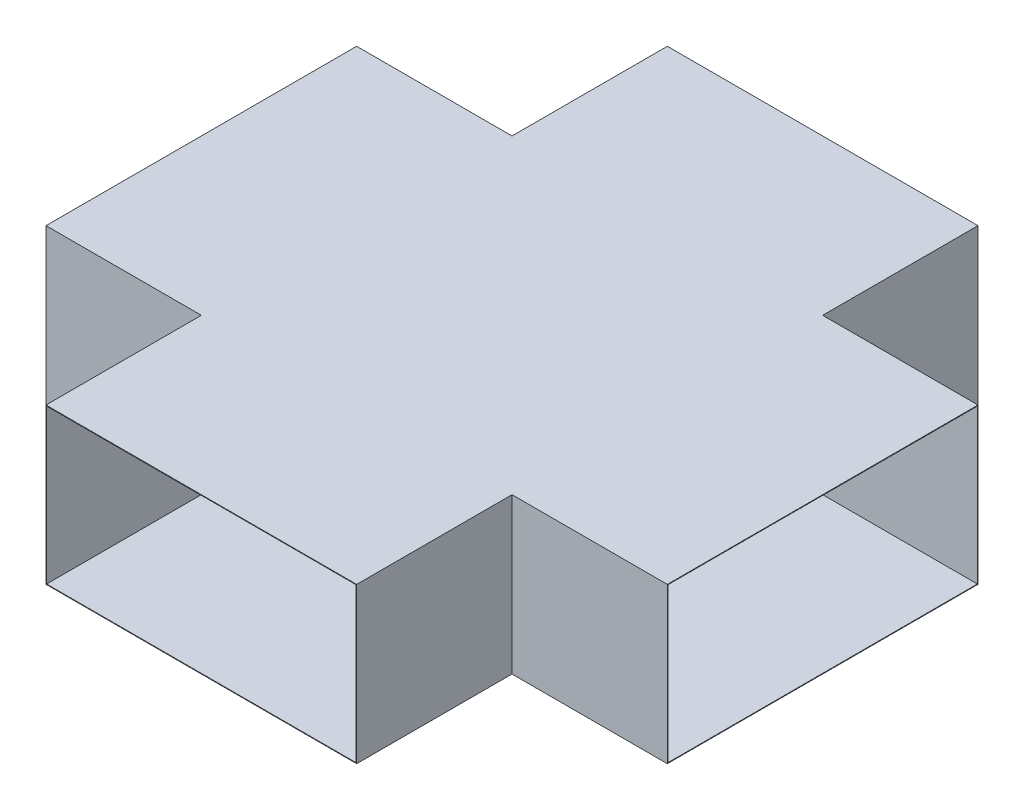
from build123d import *

# Parameters (mm, degrees)
SKETCH1_W           = 1000
SKETCH1_H           = 500
SKETCH1_W_2         = 996
SKETCH1_H_2         = 496
EXTRUDE_THIN1_DEPTH = 1000
SKETCH2_W           = 1000
SKETCH2_H           = 500
SKETCH2_W_2         = 996
SKETCH2_H_2         = 496
EXTRUDE_THIN2_DEPTH = 500
CUT_EXTRUDE1_REACH  = 2063.553
SKETCH3_W           = 996
SKETCH3_H           = 496


with BuildPart() as part:
    # Sketch1 → Extrude-Thin1 (new, symmetric)
    with BuildSketch(Plane(origin=(0, 0, 0), x_dir=(0, 0, -1), z_dir=(1, 0, 0))):
        Rectangle(SKETCH1_W, SKETCH1_H)
        Rectangle(SKETCH1_W_2, SKETCH1_H_2, mode=Mode.SUBTRACT)
    extrude(amount=EXTRUDE_THIN1_DEPTH, both=True)

    # Sketch2 → Extrude-Thin2 (add)
    with BuildSketch(Plane(origin=(0, -250, 500), x_dir=(1, 0, 0), z_dir=(0, 0, -1))):
        with Locations((0, -250)):
            Rectangle(SKETCH2_W, SKETCH2_H)
        with Locations((0, -250)):
            Rectangle(SKETCH2_W_2, SKETCH2_H_2, mode=Mode.SUBTRACT)
    extrude_thin2 = extrude(amount=-EXTRUDE_THIN2_DEPTH)

    # Sketch3 → Cut-Extrude1 (cut, up to next)
    with BuildSketch(Plane(origin=(0, -750, 1000), x_dir=(1, 0, 0), z_dir=(0, 0, -1)), mode=Mode.PRIVATE) as cut_extrude1_sk1:
        with Locations((0, -750)):
            Rectangle(SKETCH3_W, SKETCH3_H)
    cut_extrude1_tool1 = extrude(cut_extrude1_sk1.sketch, amount=CUT_EXTRUDE1_REACH, mode=Mode.PRIVATE) & part.part
    cut_extrude1 = cut_extrude1_tool1.solids().sort_by_distance((0, 0, 1000))[0]
    add(cut_extrude1, mode=Mode.SUBTRACT)

    # Mirror1: Extrude-Thin2, Cut-Extrude1 across plane
    add(extrude_thin2.mirror(Plane.XY))
    add(cut_extrude1.mirror(Plane.XY), mode=Mode.SUBTRACT)


solid = part.part
